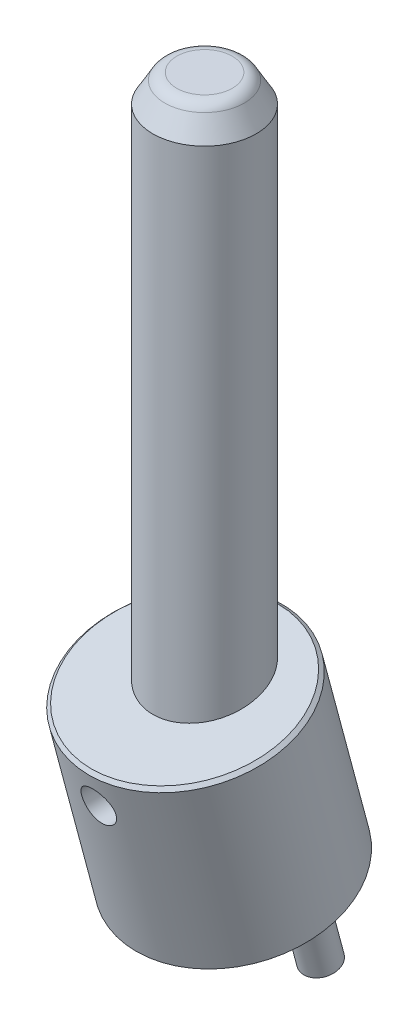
ISO-10303-21;
HEADER;
FILE_DESCRIPTION(('STEP AP214'),'2;1');
FILE_NAME('part.step','',(''),(''),'','','');
FILE_SCHEMA(('AUTOMOTIVE_DESIGN { 1 0 10303 214 1 1 1 1 }'));
ENDSEC;
DATA;
#1=APPLICATION_CONTEXT('core data for automotive mechanical design processes');
#2=APPLICATION_PROTOCOL_DEFINITION('international standard','automotive_design',2000,#1);
#3=PRODUCT_CONTEXT('',#1,'mechanical');
#4=PRODUCT('Part','Part','',(#3));
#5=PRODUCT_RELATED_PRODUCT_CATEGORY('part','',(#4));
#6=PRODUCT_DEFINITION_FORMATION('','',#4);
#7=PRODUCT_DEFINITION_CONTEXT('part definition',#1,'design');
#8=PRODUCT_DEFINITION('design','',#6,#7);
#9=PRODUCT_DEFINITION_SHAPE('','',#8);
#10=(LENGTH_UNIT() NAMED_UNIT(*) SI_UNIT(.MILLI.,.METRE.));
#11=(NAMED_UNIT(*) PLANE_ANGLE_UNIT() SI_UNIT($,.RADIAN.));
#12=(NAMED_UNIT(*) SI_UNIT($,.STERADIAN.) SOLID_ANGLE_UNIT());
#13=UNCERTAINTY_MEASURE_WITH_UNIT(LENGTH_MEASURE(1.E-05),#10,'distance_accuracy_value','');
#14=(GEOMETRIC_REPRESENTATION_CONTEXT(3) GLOBAL_UNCERTAINTY_ASSIGNED_CONTEXT((#13)) GLOBAL_UNIT_ASSIGNED_CONTEXT((#10,
#11,#12)) REPRESENTATION_CONTEXT('',''));
#15=CARTESIAN_POINT('',(0.,0.,0.));
#16=DIRECTION('',(0.,0.,1.));
#17=DIRECTION('',(1.,0.,0.));
#18=AXIS2_PLACEMENT_3D('',#15,#16,#17);
#19=CARTESIAN_POINT('',(0.,195.,0.));
#20=DIRECTION('',(0.,1.,0.));
#21=DIRECTION('',(-1.,0.,0.));
#22=AXIS2_PLACEMENT_3D('',#19,#20,#21);
#23=PLANE('',#22);
#24=CARTESIAN_POINT('',(0.,195.,0.));
#25=DIRECTION('',(0.,-1.,0.));
#26=DIRECTION('',(0.,0.,-1.));
#27=AXIS2_PLACEMENT_3D('',#24,#25,#26);
#28=CIRCLE('',#27,8.071796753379);
#29=CARTESIAN_POINT('',(0.,195.,-8.0717967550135));
#30=VERTEX_POINT('',#29);
#31=CARTESIAN_POINT('',(0.,195.,8.0717967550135));
#32=VERTEX_POINT('',#31);
#33=EDGE_CURVE('P0_E38',#30,#32,#28,.T.);
#34=ORIENTED_EDGE('',*,*,#33,.F.);
#35=CARTESIAN_POINT('',(0.,195.,0.));
#36=DIRECTION('',(0.,-1.,0.));
#37=DIRECTION('',(0.,0.,1.));
#38=AXIS2_PLACEMENT_3D('',#35,#36,#37);
#39=CIRCLE('',#38,8.071796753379);
#40=EDGE_CURVE('P0_E42',#32,#30,#39,.T.);
#41=ORIENTED_EDGE('',*,*,#40,.F.);
#42=EDGE_LOOP('',(#34,#41));
#43=FACE_BOUND('',#42,.T.);
#44=ADVANCED_FACE('P0_F17',(#43),#23,.T.);
#45=CARTESIAN_POINT('',(0.,191.,0.));
#46=DIRECTION('',(0.,1.,0.));
#47=DIRECTION('',(0.0058252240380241,0.,0.999983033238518));
#48=AXIS2_PLACEMENT_3D('',#45,#46,#47);
#49=TOROIDAL_SURFACE('',#48,8.071796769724,4.);
#50=ORIENTED_EDGE('',*,*,#33,.T.);
#51=ORIENTED_EDGE('',*,*,#40,.T.);
#52=EDGE_LOOP('',(#50,#51));
#53=FACE_BOUND('',#52,.T.);
#54=CARTESIAN_POINT('',(0.,193.000000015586,0.));
#55=DIRECTION('',(0.,-1.,0.));
#56=DIRECTION('',(0.,0.,1.));
#57=AXIS2_PLACEMENT_3D('',#54,#55,#56);
#58=CIRCLE('',#57,11.5358983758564);
#59=CARTESIAN_POINT('',(0.,193.000000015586,11.5358983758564));
#60=VERTEX_POINT('',#59);
#61=EDGE_CURVE('P0_E48',#60,#60,#58,.T.);
#62=ORIENTED_EDGE('',*,*,#61,.F.);
#63=EDGE_LOOP('',(#62));
#64=FACE_BOUND('',#63,.T.);
#65=ADVANCED_FACE('P0_F40',(#53,#64),#49,.T.);
#66=CARTESIAN_POINT('',(0.,0.,0.));
#67=DIRECTION('',(0.,1.,0.));
#68=DIRECTION('',(-1.,0.,0.));
#69=AXIS2_PLACEMENT_3D('',#66,#67,#68);
#70=PLANE('',#69);
#71=CARTESIAN_POINT('',(0.,0.,0.));
#72=DIRECTION('',(0.,1.,0.));
#73=DIRECTION('',(-1.,0.,0.));
#74=AXIS2_PLACEMENT_3D('',#71,#72,#73);
#75=CIRCLE('',#74,13.999996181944);
#76=CARTESIAN_POINT('',(-13.999996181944,0.,0.));
#77=VERTEX_POINT('',#76);
#78=EDGE_CURVE('P0_E85',#77,#77,#75,.T.);
#79=ORIENTED_EDGE('',*,*,#78,.F.);
#80=EDGE_LOOP('',(#79));
#81=FACE_BOUND('',#80,.T.);
#82=ADVANCED_FACE('P0_F76',(#81),#70,.F.);
#83=CARTESIAN_POINT('',(0.,26.,4.88675134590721));
#84=DIRECTION('',(0.,0.,1.));
#85=DIRECTION('',(0.,-1.,0.));
#86=AXIS2_PLACEMENT_3D('',#83,#84,#85);
#87=CONICAL_SURFACE('',#86,4.99999999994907,1.04719755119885);
#88=CARTESIAN_POINT('',(0.,26.0000000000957,1.99999999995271));
#89=VERTEX_POINT('',#88);
#90=VERTEX_LOOP('',#89);
#91=FACE_BOUND('',#90,.T.);
#92=CARTESIAN_POINT('',(0.,26.,4.886751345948));
#93=DIRECTION('',(0.,0.,1.));
#94=DIRECTION('',(0.,-1.,0.));
#95=AXIS2_PLACEMENT_3D('',#92,#93,#94);
#96=CIRCLE('',#95,5.);
#97=CARTESIAN_POINT('',(0.,21.,4.886751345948));
#98=VERTEX_POINT('',#97);
#99=EDGE_CURVE('P0_E82',#98,#98,#96,.T.);
#100=ORIENTED_EDGE('',*,*,#99,.T.);
#101=EDGE_LOOP('',(#100));
#102=FACE_BOUND('',#101,.T.);
#103=ADVANCED_FACE('P0_F116',(#91,#102),#87,.F.);
#104=CARTESIAN_POINT('',(0.,186.999999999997,0.));
#105=DIRECTION('',(0.,-1.,0.));
#106=DIRECTION('',(1.,0.,0.));
#107=AXIS2_PLACEMENT_3D('',#104,#105,#106);
#108=CONICAL_SURFACE('',#107,14.9999999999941,0.5235987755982);
#109=CARTESIAN_POINT('',(0.,187.,0.));
#110=DIRECTION('',(0.,1.,0.));
#111=DIRECTION('',(-1.,0.,0.));
#112=AXIS2_PLACEMENT_3D('',#109,#110,#111);
#113=CIRCLE('',#112,15.);
#114=CARTESIAN_POINT('',(-15.,187.,0.));
#115=VERTEX_POINT('',#114);
#116=EDGE_CURVE('P0_E92',#115,#115,#113,.F.);
#117=ORIENTED_EDGE('',*,*,#116,.F.);
#118=EDGE_LOOP('',(#117));
#119=FACE_BOUND('',#118,.T.);
#120=ORIENTED_EDGE('',*,*,#61,.T.);
#121=EDGE_LOOP('',(#120));
#122=FACE_BOUND('',#121,.T.);
#123=ADVANCED_FACE('P0_F108',(#119,#122),#108,.T.);
#124=CARTESIAN_POINT('',(0.,1.00000219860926,0.));
#125=DIRECTION('',(0.,1.,0.));
#126=DIRECTION('',(-1.,0.,0.));
#127=AXIS2_PLACEMENT_3D('',#124,#125,#126);
#128=CONICAL_SURFACE('',#127,14.9999981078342,0.785398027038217);
#129=CARTESIAN_POINT('',(0.,1.000000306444,0.));
#130=DIRECTION('',(0.,1.,0.));
#131=DIRECTION('',(-1.,0.,0.));
#132=AXIS2_PLACEMENT_3D('',#129,#130,#131);
#133=CIRCLE('',#132,15.);
#134=CARTESIAN_POINT('',(-15.,1.000000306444,0.));
#135=VERTEX_POINT('',#134);
#136=EDGE_CURVE('P0_E28',#135,#135,#133,.T.);
#137=ORIENTED_EDGE('',*,*,#136,.F.);
#138=EDGE_LOOP('',(#137));
#139=FACE_BOUND('',#138,.T.);
#140=ORIENTED_EDGE('',*,*,#78,.T.);
#141=EDGE_LOOP('',(#140));
#142=FACE_BOUND('',#141,.T.);
#143=ADVANCED_FACE('P0_F105',(#139,#142),#128,.T.);
#144=CARTESIAN_POINT('',(0.,26.,1.25));
#145=DIRECTION('',(0.,0.,1.));
#146=DIRECTION('',(0.,-1.,0.));
#147=AXIS2_PLACEMENT_3D('',#144,#145,#146);
#148=CYLINDRICAL_SURFACE('',#147,5.);
#149=ORIENTED_EDGE('',*,*,#99,.F.);
#150=EDGE_LOOP('',(#149));
#151=FACE_BOUND('',#150,.T.);
#152=CARTESIAN_POINT('',(0.,21.,15.));
#153=CARTESIAN_POINT('',(-0.136274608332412,21.0000000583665,14.9999999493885));
#154=CARTESIAN_POINT('',(-0.272550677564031,21.0055758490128,14.99813861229));
#155=CARTESIAN_POINT('',(-0.544142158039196,21.0278293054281,14.9907428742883));
#156=CARTESIAN_POINT('',(-0.679457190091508,21.044511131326,14.9852070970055));
#157=CARTESIAN_POINT('',(-0.948257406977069,21.0888508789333,14.9706027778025));
#158=CARTESIAN_POINT('',(-1.08174007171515,21.1165226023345,14.9615297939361));
#159=CARTESIAN_POINT('',(-1.34580155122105,21.1825990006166,14.9400929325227));
#160=CARTESIAN_POINT('',(-1.47637921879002,21.2210078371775,14.9277277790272));
#161=CARTESIAN_POINT('',(-1.7333461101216,21.308107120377,14.9000723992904));
#162=CARTESIAN_POINT('',(-1.85974572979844,21.356769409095,14.8847901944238));
#163=CARTESIAN_POINT('',(-2.10792399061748,21.4640368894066,14.8516789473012));
#164=CARTESIAN_POINT('',(-2.22970089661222,21.5226457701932,14.8338489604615));
#165=CARTESIAN_POINT('',(-2.58680471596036,21.7126929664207,14.7772227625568));
#166=CARTESIAN_POINT('',(-2.81420620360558,21.8584546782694,14.7352562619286));
#167=CARTESIAN_POINT('',(-3.24874257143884,22.1891412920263,14.6457020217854));
#168=CARTESIAN_POINT('',(-3.45501840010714,22.3751508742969,14.5979792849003));
#169=CARTESIAN_POINT('',(-3.8341436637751,22.7788198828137,14.5030192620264));
#170=CARTESIAN_POINT('',(-4.0069839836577,22.9964879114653,14.4557821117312));
#171=CARTESIAN_POINT('',(-4.31912807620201,23.4649273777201,14.3656662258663));
#172=CARTESIAN_POINT('',(-4.45732572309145,23.716470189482,14.3229516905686));
#173=CARTESIAN_POINT('',(-4.68909399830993,24.2408813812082,14.2487652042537));
#174=CARTESIAN_POINT('',(-4.78267844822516,24.5137431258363,14.2172897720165));
#175=CARTESIAN_POINT('',(-4.91936749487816,25.0633661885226,14.1705651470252));
#176=CARTESIAN_POINT('',(-4.96406724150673,25.3396860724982,14.15480479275));
#177=CARTESIAN_POINT('',(-5.00670561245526,25.8963186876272,14.1397828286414));
#178=CARTESIAN_POINT('',(-5.00465868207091,26.176630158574,14.1405161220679));
#179=CARTESIAN_POINT('',(-4.95509941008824,26.7196826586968,14.1579507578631));
#180=CARTESIAN_POINT('',(-4.90966912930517,26.9826412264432,14.1739208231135));
#181=CARTESIAN_POINT('',(-4.77803186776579,27.4969654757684,14.2188326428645));
#182=CARTESIAN_POINT('',(-4.69181981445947,27.7483297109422,14.2477760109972));
#183=CARTESIAN_POINT('',(-4.47968995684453,28.2370720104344,14.3158968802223));
#184=CARTESIAN_POINT('',(-4.3531541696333,28.4741591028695,14.3552319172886));
#185=CARTESIAN_POINT('',(-4.06444611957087,28.9243597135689,14.4396288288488));
#186=CARTESIAN_POINT('',(-3.90226546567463,29.1374675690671,14.4846920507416));
#187=CARTESIAN_POINT('',(-3.53674216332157,29.5454469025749,14.5783642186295));
#188=CARTESIAN_POINT('',(-3.33169626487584,29.7387915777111,14.6270356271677));
#189=CARTESIAN_POINT('',(-3.00176707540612,30.0011551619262,14.6970107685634));
#190=CARTESIAN_POINT('',(-2.88796886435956,30.0840532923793,14.7198467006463));
#191=CARTESIAN_POINT('',(-2.65358317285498,30.2400803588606,14.7638979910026));
#192=CARTESIAN_POINT('',(-2.53299841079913,30.3132131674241,14.7851139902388));
#193=CARTESIAN_POINT('',(-2.28442944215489,30.4499136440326,14.8255663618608));
#194=CARTESIAN_POINT('',(-2.15637801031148,30.5133662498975,14.8447781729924));
#195=CARTESIAN_POINT('',(-1.89503347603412,30.6291752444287,14.8803974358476));
#196=CARTESIAN_POINT('',(-1.76174256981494,30.681536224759,14.8968060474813));
#197=CARTESIAN_POINT('',(-1.49104566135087,30.7746452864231,14.9263287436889));
#198=CARTESIAN_POINT('',(-1.3536464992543,30.8154115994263,14.9394479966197));
#199=CARTESIAN_POINT('',(-1.0756272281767,30.8850331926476,14.9620340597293));
#200=CARTESIAN_POINT('',(-0.935008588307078,30.9138937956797,14.9715025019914));
#201=CARTESIAN_POINT('',(-0.662330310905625,30.9577132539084,14.9859443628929));
#202=CARTESIAN_POINT('',(-0.530427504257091,30.9735582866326,14.9912035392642));
#203=CARTESIAN_POINT('',(-0.265683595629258,30.994701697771,14.998231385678));
#204=CARTESIAN_POINT('',(-0.132842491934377,31.0000000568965,15.0000000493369));
#205=CARTESIAN_POINT('',(0.13627460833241,30.9999999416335,14.9999999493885));
#206=CARTESIAN_POINT('',(0.272550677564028,30.9944241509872,14.99813861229));
#207=CARTESIAN_POINT('',(0.544142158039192,30.9721706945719,14.9907428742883));
#208=CARTESIAN_POINT('',(0.679457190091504,30.955488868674,14.9852070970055));
#209=CARTESIAN_POINT('',(0.948257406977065,30.9111491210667,14.9706027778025));
#210=CARTESIAN_POINT('',(1.08174007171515,30.8834773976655,14.9615297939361));
#211=CARTESIAN_POINT('',(1.34580155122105,30.8174009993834,14.9400929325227));
#212=CARTESIAN_POINT('',(1.47637921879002,30.7789921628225,14.9277277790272));
#213=CARTESIAN_POINT('',(1.7333461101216,30.691892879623,14.9000723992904));
#214=CARTESIAN_POINT('',(1.85974572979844,30.643230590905,14.8847901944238));
#215=CARTESIAN_POINT('',(2.10792399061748,30.5359631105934,14.8516789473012));
#216=CARTESIAN_POINT('',(2.22970089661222,30.4773542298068,14.8338489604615));
#217=CARTESIAN_POINT('',(2.58680471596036,30.2873070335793,14.7772227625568));
#218=CARTESIAN_POINT('',(2.81420620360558,30.1415453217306,14.7352562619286));
#219=CARTESIAN_POINT('',(3.24874257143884,29.8108587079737,14.6457020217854));
#220=CARTESIAN_POINT('',(3.45501840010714,29.6248491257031,14.5979792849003));
#221=CARTESIAN_POINT('',(3.8341436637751,29.2211801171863,14.5030192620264));
#222=CARTESIAN_POINT('',(4.0069839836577,29.0035120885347,14.4557821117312));
#223=CARTESIAN_POINT('',(4.31912807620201,28.5350726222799,14.3656662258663));
#224=CARTESIAN_POINT('',(4.45732572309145,28.283529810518,14.3229516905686));
#225=CARTESIAN_POINT('',(4.68909399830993,27.7591186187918,14.2487652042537));
#226=CARTESIAN_POINT('',(4.78267844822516,27.4862568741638,14.2172897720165));
#227=CARTESIAN_POINT('',(4.91936749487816,26.9366338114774,14.1705651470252));
#228=CARTESIAN_POINT('',(4.96406724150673,26.6603139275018,14.15480479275));
#229=CARTESIAN_POINT('',(5.00670561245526,26.1036813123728,14.1397828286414));
#230=CARTESIAN_POINT('',(5.00465868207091,25.823369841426,14.1405161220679));
#231=CARTESIAN_POINT('',(4.95509941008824,25.2803173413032,14.1579507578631));
#232=CARTESIAN_POINT('',(4.90966912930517,25.0173587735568,14.1739208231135));
#233=CARTESIAN_POINT('',(4.77803186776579,24.5030345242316,14.2188326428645));
#234=CARTESIAN_POINT('',(4.69181981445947,24.2516702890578,14.2477760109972));
#235=CARTESIAN_POINT('',(4.47968995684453,23.7629279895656,14.3158968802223));
#236=CARTESIAN_POINT('',(4.35315416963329,23.5258408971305,14.3552319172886));
#237=CARTESIAN_POINT('',(4.06444611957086,23.0756402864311,14.4396288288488));
#238=CARTESIAN_POINT('',(3.90226546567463,22.8625324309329,14.4846920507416));
#239=CARTESIAN_POINT('',(3.53674216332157,22.4545530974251,14.5783642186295));
#240=CARTESIAN_POINT('',(3.33169626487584,22.2612084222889,14.6270356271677));
#241=CARTESIAN_POINT('',(3.00176707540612,21.9988448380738,14.6970107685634));
#242=CARTESIAN_POINT('',(2.88796886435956,21.9159467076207,14.7198467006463));
#243=CARTESIAN_POINT('',(2.65358317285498,21.7599196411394,14.7638979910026));
#244=CARTESIAN_POINT('',(2.53299841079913,21.6867868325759,14.7851139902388));
#245=CARTESIAN_POINT('',(2.28442944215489,21.5500863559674,14.8255663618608));
#246=CARTESIAN_POINT('',(2.15637801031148,21.4866337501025,14.8447781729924));
#247=CARTESIAN_POINT('',(1.89503347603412,21.3708247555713,14.8803974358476));
#248=CARTESIAN_POINT('',(1.76174256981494,21.318463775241,14.8968060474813));
#249=CARTESIAN_POINT('',(1.49104566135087,21.2253547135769,14.9263287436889));
#250=CARTESIAN_POINT('',(1.3536464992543,21.1845884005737,14.9394479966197));
#251=CARTESIAN_POINT('',(1.07562722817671,21.1149668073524,14.9620340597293));
#252=CARTESIAN_POINT('',(0.935008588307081,21.0861062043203,14.9715025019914));
#253=CARTESIAN_POINT('',(0.662330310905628,21.0422867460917,14.9859443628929));
#254=CARTESIAN_POINT('',(0.530427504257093,21.0264417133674,14.9912035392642));
#255=CARTESIAN_POINT('',(0.265683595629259,21.005298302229,14.998231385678));
#256=CARTESIAN_POINT('',(0.132842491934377,20.9999999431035,15.0000000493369));
#257=CARTESIAN_POINT('',(0.,21.,15.));
#258=B_SPLINE_CURVE_WITH_KNOTS('',3,(#152,#153,#154,#155,#156,#157,#158,#159,#160,#161,#162,
#163,#164,#165,#166,#167,#168,#169,#170,#171,#172,#173,#174,#175,#176,#177,#178,#179,#180,#181,
#182,#183,#184,#185,#186,#187,#188,#189,#190,#191,#192,#193,#194,#195,#196,#197,#198,#199,#200,
#201,#202,#203,#204,#205,#206,#207,#208,#209,#210,#211,#212,#213,#214,#215,#216,#217,#218,#219,
#220,#221,#222,#223,#224,#225,#226,#227,#228,#229,#230,#231,#232,#233,#234,#235,#236,#237,#238,
#239,#240,#241,#242,#243,#244,#245,#246,#247,#248,#249,#250,#251,#252,#253,#254,#255,#256,#257),
.UNSPECIFIED.,.T.,.F.,(4,2,2,2,2,2,2,2,2,2,2,2,2,2,2,2,2,2,2,2,2,2,2,2,2,2,2,2,2,2,2,2,2,2,2,2,
2,2,2,2,2,2,2,2,2,2,2,2,2,2,2,2,4),(0.,0.408700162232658,0.817553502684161,1.22692193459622,
1.6364492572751,2.04486626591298,2.45343508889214,3.26962321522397,4.11140352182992,
4.9534129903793,5.81961254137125,6.68554356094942,7.52228757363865,8.3587730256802,
9.15703078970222,9.95538786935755,10.7666215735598,11.5780464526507,12.4317109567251,
12.8591940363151,13.286507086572,13.7185586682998,14.150431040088,14.5816205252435,
15.0126170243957,15.4110232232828,15.8094301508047,16.2181303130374,16.6269836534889,
17.0363520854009,17.4458794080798,17.8542964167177,18.2628652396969,19.0790533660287,
19.9208336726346,20.762843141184,21.629042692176,22.4949737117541,23.3317177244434,
24.1682031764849,24.9664609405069,25.7648180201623,26.5760517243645,27.3874766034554,
28.2411411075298,28.6686241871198,29.0959372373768,29.5279888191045,29.9598611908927,
30.3910506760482,30.8220471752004,31.2204533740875,31.6188603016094),.UNSPECIFIED.);
#259=CARTESIAN_POINT('',(0.,21.,15.));
#260=VERTEX_POINT('',#259);
#261=EDGE_CURVE('P0_E11',#260,#260,#258,.T.);
#262=ORIENTED_EDGE('',*,*,#261,.F.);
#263=EDGE_LOOP('',(#262));
#264=FACE_BOUND('',#263,.T.);
#265=ADVANCED_FACE('P0_F107',(#151,#264),#148,.F.);
#266=CARTESIAN_POINT('',(0.,-9.75,0.));
#267=DIRECTION('',(0.,1.,0.));
#268=DIRECTION('',(-1.,0.,0.));
#269=AXIS2_PLACEMENT_3D('',#266,#267,#268);
#270=CYLINDRICAL_SURFACE('',#269,15.);
#271=ORIENTED_EDGE('',*,*,#116,.T.);
#272=EDGE_LOOP('',(#271));
#273=FACE_BOUND('',#272,.T.);
#274=ORIENTED_EDGE('',*,*,#136,.T.);
#275=EDGE_LOOP('',(#274));
#276=FACE_BOUND('',#275,.T.);
#277=ORIENTED_EDGE('',*,*,#261,.T.);
#278=EDGE_LOOP('',(#277));
#279=FACE_BOUND('',#278,.T.);
#280=ADVANCED_FACE('P0_F102',(#273,#276,#279),#270,.T.);
#281=CLOSED_SHELL('',(#44,#65,#82,#103,#123,#143,#265,#280));
#282=MANIFOLD_SOLID_BREP('P0_B1',#281);
#283=CARTESIAN_POINT('',(0.,-24.1677221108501,-12.3217781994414));
#284=DIRECTION('',(0.,-0.965925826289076,-0.258819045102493));
#285=DIRECTION('',(0.,0.258819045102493,-0.965925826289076));
#286=AXIS2_PLACEMENT_3D('',#283,#284,#285);
#287=PLANE('',#286);
#288=CARTESIAN_POINT('',(-21.5,-24.1677221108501,-12.3217781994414));
#289=DIRECTION('',(0.,-0.965925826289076,-0.258819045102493));
#290=DIRECTION('',(0.,0.258819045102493,-0.965925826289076));
#291=AXIS2_PLACEMENT_3D('',#288,#289,#290);
#292=CIRCLE('',#291,4.50000075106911);
#293=CARTESIAN_POINT('',(-21.5,-23.0030362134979,-16.6684451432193));
#294=VERTEX_POINT('',#293);
#295=EDGE_CURVE('P1_E17',#294,#294,#292,.F.);
#296=ORIENTED_EDGE('',*,*,#295,.F.);
#297=EDGE_LOOP('',(#296));
#298=FACE_BOUND('',#297,.T.);
#299=ADVANCED_FACE('P1_F14',(#298),#287,.T.);
#300=CARTESIAN_POINT('',(0.,-24.1677221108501,-12.3217781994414));
#301=DIRECTION('',(0.,-0.965925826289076,-0.258819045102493));
#302=DIRECTION('',(0.,0.258819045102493,-0.965925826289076));
#303=AXIS2_PLACEMENT_3D('',#300,#301,#302);
#304=PLANE('',#303);
#305=CARTESIAN_POINT('',(21.5,-24.1677221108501,-12.3217781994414));
#306=DIRECTION('',(0.,-0.965925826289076,-0.258819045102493));
#307=DIRECTION('',(0.,0.258819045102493,-0.965925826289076));
#308=AXIS2_PLACEMENT_3D('',#305,#306,#307);
#309=CIRCLE('',#308,4.50000075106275);
#310=CARTESIAN_POINT('',(21.5,-23.0030362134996,-16.6684451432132));
#311=VERTEX_POINT('',#310);
#312=EDGE_CURVE('P1_E121',#311,#311,#309,.F.);
#313=ORIENTED_EDGE('',*,*,#312,.F.);
#314=EDGE_LOOP('',(#313));
#315=FACE_BOUND('',#314,.T.);
#316=ADVANCED_FACE('P1_F111',(#315),#304,.T.);
#317=CARTESIAN_POINT('',(0.,-1.62717062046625E-12,-9.59302082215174E-13));
#318=DIRECTION('',(0.,-1.,0.));
#319=DIRECTION('',(0.,0.,-1.));
#320=AXIS2_PLACEMENT_3D('',#317,#318,#319);
#321=PLANE('',#320);
#322=CARTESIAN_POINT('',(0.,-3.64291929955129E-13,-6.07500161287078E-12));
#323=DIRECTION('',(0.,-1.,0.));
#324=DIRECTION('',(0.,0.,-1.));
#325=AXIS2_PLACEMENT_3D('',#322,#323,#324);
#326=CIRCLE('',#325,15.);
#327=CARTESIAN_POINT('',(0.,-3.64291929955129E-13,-15.0000000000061));
#328=VERTEX_POINT('',#327);
#329=EDGE_CURVE('P1_E36',#328,#328,#326,.F.);
#330=ORIENTED_EDGE('',*,*,#329,.T.);
#331=EDGE_LOOP('',(#330));
#332=FACE_BOUND('',#331,.T.);
#333=ADVANCED_FACE('P1_F108',(#332),#321,.F.);
#334=CARTESIAN_POINT('',(-21.5,-23.6847586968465,-12.1923685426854));
#335=DIRECTION('',(0.,0.965925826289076,0.258819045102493));
#336=DIRECTION('',(0.,-0.258819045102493,0.965925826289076));
#337=AXIS2_PLACEMENT_3D('',#334,#335,#336);
#338=CONICAL_SURFACE('',#337,5.00000135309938,0.785398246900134);
#339=CARTESIAN_POINT('',(-21.5,-23.6847573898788,-12.1923681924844));
#340=DIRECTION('',(0.,-0.965925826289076,-0.258819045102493));
#341=DIRECTION('',(0.,0.258819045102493,-0.965925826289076));
#342=AXIS2_PLACEMENT_3D('',#339,#340,#341);
#343=CIRCLE('',#342,5.);
#344=CARTESIAN_POINT('',(-21.5,-22.3906621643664,-17.0219973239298));
#345=VERTEX_POINT('',#344);
#346=EDGE_CURVE('P1_E33',#345,#345,#343,.F.);
#347=ORIENTED_EDGE('',*,*,#346,.F.);
#348=EDGE_LOOP('',(#347));
#349=FACE_BOUND('',#348,.T.);
#350=ORIENTED_EDGE('',*,*,#295,.T.);
#351=EDGE_LOOP('',(#350));
#352=FACE_BOUND('',#351,.T.);
#353=ADVANCED_FACE('P1_F104',(#349,#352),#338,.T.);
#354=CARTESIAN_POINT('',(21.5,-23.6847586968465,-12.1923685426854));
#355=DIRECTION('',(0.,0.965925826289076,0.258819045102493));
#356=DIRECTION('',(0.,-0.258819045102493,0.965925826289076));
#357=AXIS2_PLACEMENT_3D('',#354,#355,#356);
#358=CONICAL_SURFACE('',#357,5.00000135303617,0.785398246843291);
#359=CARTESIAN_POINT('',(21.5,-23.6847573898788,-12.1923681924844));
#360=DIRECTION('',(0.,-0.965925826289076,-0.258819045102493));
#361=DIRECTION('',(0.,0.258819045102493,-0.965925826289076));
#362=AXIS2_PLACEMENT_3D('',#359,#360,#361);
#363=CIRCLE('',#362,5.);
#364=CARTESIAN_POINT('',(21.5,-22.3906621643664,-17.0219973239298));
#365=VERTEX_POINT('',#364);
#366=EDGE_CURVE('P1_E29',#365,#365,#363,.F.);
#367=ORIENTED_EDGE('',*,*,#366,.F.);
#368=EDGE_LOOP('',(#367));
#369=FACE_BOUND('',#368,.T.);
#370=ORIENTED_EDGE('',*,*,#312,.T.);
#371=EDGE_LOOP('',(#370));
#372=FACE_BOUND('',#371,.T.);
#373=ADVANCED_FACE('P1_F99',(#369,#372),#358,.T.);
#374=CARTESIAN_POINT('',(0.,61.8750000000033,-6.0732668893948E-12));
#375=DIRECTION('',(0.,-1.,0.));
#376=DIRECTION('',(0.,0.,-1.));
#377=AXIS2_PLACEMENT_3D('',#374,#375,#376);
#378=CYLINDRICAL_SURFACE('',#377,15.);
#379=CARTESIAN_POINT('',(0.,45.0000000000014,-6.07500161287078E-12));
#380=DIRECTION('',(0.,0.965925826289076,0.258819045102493));
#381=DIRECTION('',(0.,-0.258819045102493,0.965925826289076));
#382=AXIS2_PLACEMENT_3D('',#379,#380,#381);
#383=ELLIPSE('',#382,15.5291427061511,15.);
#384=CARTESIAN_POINT('',(0.,40.980762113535,14.9999999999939));
#385=VERTEX_POINT('',#384);
#386=EDGE_CURVE('P1_E32',#385,#385,#383,.F.);
#387=ORIENTED_EDGE('',*,*,#386,.F.);
#388=EDGE_LOOP('',(#387));
#389=FACE_BOUND('',#388,.T.);
#390=ORIENTED_EDGE('',*,*,#329,.F.);
#391=EDGE_LOOP('',(#390));
#392=FACE_BOUND('',#391,.T.);
#393=CARTESIAN_POINT('',(0.,30.9999999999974,14.9999999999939));
#394=CARTESIAN_POINT('',(-0.136274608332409,30.9999999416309,14.9999999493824));
#395=CARTESIAN_POINT('',(-0.272550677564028,30.9944241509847,14.9981386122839));
#396=CARTESIAN_POINT('',(-0.544142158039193,30.9721706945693,14.9907428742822));
#397=CARTESIAN_POINT('',(-0.679457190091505,30.9554888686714,14.9852070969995));
#398=CARTESIAN_POINT('',(-0.948257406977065,30.9111491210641,14.9706027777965));
#399=CARTESIAN_POINT('',(-1.08174007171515,30.883477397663,14.96152979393));
#400=CARTESIAN_POINT('',(-1.34580155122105,30.8174009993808,14.9400929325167));
#401=CARTESIAN_POINT('',(-1.47637921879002,30.77899216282,14.9277277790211));
#402=CARTESIAN_POINT('',(-1.7333461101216,30.6918928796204,14.9000723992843));
#403=CARTESIAN_POINT('',(-1.85974572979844,30.6432305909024,14.8847901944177));
#404=CARTESIAN_POINT('',(-2.10792399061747,30.5359631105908,14.8516789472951));
#405=CARTESIAN_POINT('',(-2.22970089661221,30.4773542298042,14.8338489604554));
#406=CARTESIAN_POINT('',(-2.58680471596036,30.2873070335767,14.7772227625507));
#407=CARTESIAN_POINT('',(-2.81420620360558,30.141545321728,14.7352562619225));
#408=CARTESIAN_POINT('',(-3.24874257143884,29.8108587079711,14.6457020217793));
#409=CARTESIAN_POINT('',(-3.45501840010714,29.6248491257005,14.5979792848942));
#410=CARTESIAN_POINT('',(-3.8341436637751,29.2211801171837,14.5030192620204));
#411=CARTESIAN_POINT('',(-4.0069839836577,29.0035120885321,14.4557821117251));
#412=CARTESIAN_POINT('',(-4.31912807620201,28.5350726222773,14.3656662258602));
#413=CARTESIAN_POINT('',(-4.45732572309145,28.2835298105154,14.3229516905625));
#414=CARTESIAN_POINT('',(-4.68909399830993,27.7591186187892,14.2487652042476));
#415=CARTESIAN_POINT('',(-4.78267844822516,27.4862568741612,14.2172897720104));
#416=CARTESIAN_POINT('',(-4.91936749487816,26.9366338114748,14.1705651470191));
#417=CARTESIAN_POINT('',(-4.96406724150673,26.6603139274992,14.1548047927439));
#418=CARTESIAN_POINT('',(-5.00670561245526,26.1036813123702,14.1397828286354));
#419=CARTESIAN_POINT('',(-5.00465868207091,25.8233698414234,14.1405161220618));
#420=CARTESIAN_POINT('',(-4.95509941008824,25.2803173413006,14.157950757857));
#421=CARTESIAN_POINT('',(-4.90966912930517,25.0173587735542,14.1739208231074));
#422=CARTESIAN_POINT('',(-4.77803186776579,24.503034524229,14.2188326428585));
#423=CARTESIAN_POINT('',(-4.69181981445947,24.2516702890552,14.2477760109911));
#424=CARTESIAN_POINT('',(-4.47968995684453,23.762927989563,14.3158968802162));
#425=CARTESIAN_POINT('',(-4.3531541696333,23.5258408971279,14.3552319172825));
#426=CARTESIAN_POINT('',(-4.06444611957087,23.0756402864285,14.4396288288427));
#427=CARTESIAN_POINT('',(-3.90226546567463,22.8625324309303,14.4846920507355));
#428=CARTESIAN_POINT('',(-3.53674216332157,22.4545530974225,14.5783642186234));
#429=CARTESIAN_POINT('',(-3.33169626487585,22.2612084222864,14.6270356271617));
#430=CARTESIAN_POINT('',(-3.00176707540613,21.9988448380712,14.6970107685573));
#431=CARTESIAN_POINT('',(-2.88796886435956,21.9159467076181,14.7198467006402));
#432=CARTESIAN_POINT('',(-2.65358317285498,21.7599196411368,14.7638979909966));
#433=CARTESIAN_POINT('',(-2.53299841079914,21.6867868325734,14.7851139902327));
#434=CARTESIAN_POINT('',(-2.2844294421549,21.5500863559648,14.8255663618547));
#435=CARTESIAN_POINT('',(-2.15637801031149,21.4866337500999,14.8447781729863));
#436=CARTESIAN_POINT('',(-1.89503347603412,21.3708247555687,14.8803974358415));
#437=CARTESIAN_POINT('',(-1.76174256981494,21.3184637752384,14.8968060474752));
#438=CARTESIAN_POINT('',(-1.49104566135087,21.2253547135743,14.9263287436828));
#439=CARTESIAN_POINT('',(-1.35364649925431,21.1845884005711,14.9394479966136));
#440=CARTESIAN_POINT('',(-1.07562722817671,21.1149668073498,14.9620340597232));
#441=CARTESIAN_POINT('',(-0.935008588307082,21.0861062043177,14.9715025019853));
#442=CARTESIAN_POINT('',(-0.66233031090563,21.0422867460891,14.9859443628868));
#443=CARTESIAN_POINT('',(-0.530427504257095,21.0264417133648,14.9912035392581));
#444=CARTESIAN_POINT('',(-0.265683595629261,21.0052983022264,14.9982313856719));
#445=CARTESIAN_POINT('',(-0.132842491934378,20.9999999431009,15.0000000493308));
#446=CARTESIAN_POINT('',(0.136274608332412,21.0000000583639,14.9999999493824));
#447=CARTESIAN_POINT('',(0.272550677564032,21.0055758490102,14.9981386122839));
#448=CARTESIAN_POINT('',(0.544142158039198,21.0278293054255,14.9907428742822));
#449=CARTESIAN_POINT('',(0.67945719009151,21.0445111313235,14.9852070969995));
#450=CARTESIAN_POINT('',(0.94825740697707,21.0888508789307,14.9706027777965));
#451=CARTESIAN_POINT('',(1.08174007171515,21.1165226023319,14.96152979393));
#452=CARTESIAN_POINT('',(1.34580155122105,21.182599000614,14.9400929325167));
#453=CARTESIAN_POINT('',(1.47637921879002,21.2210078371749,14.9277277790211));
#454=CARTESIAN_POINT('',(1.7333461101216,21.3081071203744,14.9000723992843));
#455=CARTESIAN_POINT('',(1.85974572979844,21.3567694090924,14.8847901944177));
#456=CARTESIAN_POINT('',(2.10792399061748,21.464036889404,14.8516789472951));
#457=CARTESIAN_POINT('',(2.22970089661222,21.5226457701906,14.8338489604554));
#458=CARTESIAN_POINT('',(2.58680471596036,21.7126929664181,14.7772227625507));
#459=CARTESIAN_POINT('',(2.81420620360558,21.8584546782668,14.7352562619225));
#460=CARTESIAN_POINT('',(3.24874257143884,22.1891412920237,14.6457020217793));
#461=CARTESIAN_POINT('',(3.45501840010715,22.3751508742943,14.5979792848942));
#462=CARTESIAN_POINT('',(3.8341436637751,22.7788198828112,14.5030192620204));
#463=CARTESIAN_POINT('',(4.0069839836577,22.9964879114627,14.4557821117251));
#464=CARTESIAN_POINT('',(4.31912807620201,23.4649273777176,14.3656662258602));
#465=CARTESIAN_POINT('',(4.45732572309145,23.7164701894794,14.3229516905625));
#466=CARTESIAN_POINT('',(4.68909399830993,24.2408813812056,14.2487652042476));
#467=CARTESIAN_POINT('',(4.78267844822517,24.5137431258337,14.2172897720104));
#468=CARTESIAN_POINT('',(4.91936749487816,25.06336618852,14.1705651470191));
#469=CARTESIAN_POINT('',(4.96406724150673,25.3396860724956,14.1548047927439));
#470=CARTESIAN_POINT('',(5.00670561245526,25.8963186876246,14.1397828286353));
#471=CARTESIAN_POINT('',(5.00465868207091,26.1766301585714,14.1405161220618));
#472=CARTESIAN_POINT('',(4.95509941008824,26.7196826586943,14.157950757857));
#473=CARTESIAN_POINT('',(4.90966912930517,26.9826412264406,14.1739208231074));
#474=CARTESIAN_POINT('',(4.77803186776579,27.4969654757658,14.2188326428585));
#475=CARTESIAN_POINT('',(4.69181981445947,27.7483297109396,14.2477760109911));
#476=CARTESIAN_POINT('',(4.47968995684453,28.2370720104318,14.3158968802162));
#477=CARTESIAN_POINT('',(4.35315416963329,28.4741591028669,14.3552319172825));
#478=CARTESIAN_POINT('',(4.06444611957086,28.9243597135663,14.4396288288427));
#479=CARTESIAN_POINT('',(3.90226546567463,29.1374675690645,14.4846920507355));
#480=CARTESIAN_POINT('',(3.53674216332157,29.5454469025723,14.5783642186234));
#481=CARTESIAN_POINT('',(3.33169626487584,29.7387915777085,14.6270356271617));
#482=CARTESIAN_POINT('',(3.00176707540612,30.0011551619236,14.6970107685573));
#483=CARTESIAN_POINT('',(2.88796886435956,30.0840532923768,14.7198467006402));
#484=CARTESIAN_POINT('',(2.65358317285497,30.240080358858,14.7638979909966));
#485=CARTESIAN_POINT('',(2.53299841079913,30.3132131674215,14.7851139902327));
#486=CARTESIAN_POINT('',(2.28442944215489,30.44991364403,14.8255663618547));
#487=CARTESIAN_POINT('',(2.15637801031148,30.5133662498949,14.8447781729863));
#488=CARTESIAN_POINT('',(1.89503347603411,30.6291752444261,14.8803974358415));
#489=CARTESIAN_POINT('',(1.76174256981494,30.6815362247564,14.8968060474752));
#490=CARTESIAN_POINT('',(1.49104566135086,30.7746452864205,14.9263287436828));
#491=CARTESIAN_POINT('',(1.3536464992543,30.8154115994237,14.9394479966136));
#492=CARTESIAN_POINT('',(1.0756272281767,30.885033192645,14.9620340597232));
#493=CARTESIAN_POINT('',(0.935008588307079,30.9138937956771,14.9715025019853));
#494=CARTESIAN_POINT('',(0.662330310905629,30.9577132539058,14.9859443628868));
#495=CARTESIAN_POINT('',(0.530427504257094,30.97355828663,14.9912035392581));
#496=CARTESIAN_POINT('',(0.26568359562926,30.9947016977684,14.9982313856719));
#497=CARTESIAN_POINT('',(0.132842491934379,31.000000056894,15.0000000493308));
#498=CARTESIAN_POINT('',(0.,30.9999999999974,14.9999999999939));
#499=B_SPLINE_CURVE_WITH_KNOTS('',3,(#393,#394,#395,#396,#397,#398,#399,#400,#401,#402,#403,
#404,#405,#406,#407,#408,#409,#410,#411,#412,#413,#414,#415,#416,#417,#418,#419,#420,#421,#422,
#423,#424,#425,#426,#427,#428,#429,#430,#431,#432,#433,#434,#435,#436,#437,#438,#439,#440,#441,
#442,#443,#444,#445,#446,#447,#448,#449,#450,#451,#452,#453,#454,#455,#456,#457,#458,#459,#460,
#461,#462,#463,#464,#465,#466,#467,#468,#469,#470,#471,#472,#473,#474,#475,#476,#477,#478,#479,
#480,#481,#482,#483,#484,#485,#486,#487,#488,#489,#490,#491,#492,#493,#494,#495,#496,#497,#498),
.UNSPECIFIED.,.T.,.F.,(4,2,2,2,2,2,2,2,2,2,2,2,2,2,2,2,2,2,2,2,2,2,2,2,2,2,2,2,2,2,2,2,2,2,2,2,
2,2,2,2,2,2,2,2,2,2,2,2,2,2,2,2,4),(0.,0.408700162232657,0.81755350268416,1.22692193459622,
1.63644925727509,2.04486626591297,2.45343508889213,3.26962321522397,4.11140352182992,
4.9534129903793,5.81961254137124,6.68554356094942,7.52228757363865,8.3587730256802,
9.15703078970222,9.95538786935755,10.7666215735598,11.5780464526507,12.4317109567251,
12.8591940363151,13.286507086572,13.7185586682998,14.150431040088,14.5816205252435,
15.0126170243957,15.4110232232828,15.8094301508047,16.2181303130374,16.6269836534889,
17.0363520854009,17.4458794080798,17.8542964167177,18.2628652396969,19.0790533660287,
19.9208336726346,20.762843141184,21.629042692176,22.4949737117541,23.3317177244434,
24.1682031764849,24.9664609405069,25.7648180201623,26.5760517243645,27.3874766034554,
28.2411411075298,28.6686241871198,29.0959372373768,29.5279888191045,29.9598611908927,
30.3910506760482,30.8220471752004,31.2204533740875,31.6188603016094),.UNSPECIFIED.);
#500=CARTESIAN_POINT('',(0.,30.9999999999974,14.9999999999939));
#501=VERTEX_POINT('',#500);
#502=EDGE_CURVE('P1_E84',#501,#501,#499,.T.);
#503=ORIENTED_EDGE('',*,*,#502,.T.);
#504=EDGE_LOOP('',(#503));
#505=FACE_BOUND('',#504,.T.);
#506=ADVANCED_FACE('P1_F93',(#389,#392,#505),#378,.F.);
#507=CARTESIAN_POINT('',(-21.5,-9.678834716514,-8.439492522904));
#508=DIRECTION('',(0.,-0.965925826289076,-0.258819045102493));
#509=DIRECTION('',(0.,0.258819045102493,-0.965925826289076));
#510=AXIS2_PLACEMENT_3D('',#507,#508,#509);
#511=CYLINDRICAL_SURFACE('',#510,5.);
#512=CARTESIAN_POINT('',(-21.5,-9.678834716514,-8.439492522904));
#513=DIRECTION('',(0.,-0.965925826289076,-0.258819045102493));
#514=DIRECTION('',(0.,0.258819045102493,-0.965925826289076));
#515=AXIS2_PLACEMENT_3D('',#512,#513,#514);
#516=CIRCLE('',#515,5.);
#517=CARTESIAN_POINT('',(-21.5,-8.38473949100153,-13.2691216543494));
#518=VERTEX_POINT('',#517);
#519=EDGE_CURVE('P1_E80',#518,#518,#516,.T.);
#520=ORIENTED_EDGE('',*,*,#519,.T.);
#521=EDGE_LOOP('',(#520));
#522=FACE_BOUND('',#521,.T.);
#523=ORIENTED_EDGE('',*,*,#346,.T.);
#524=EDGE_LOOP('',(#523));
#525=FACE_BOUND('',#524,.T.);
#526=ADVANCED_FACE('P1_F98',(#522,#525),#511,.T.);
#527=CARTESIAN_POINT('',(21.5,-9.678834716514,-8.439492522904));
#528=DIRECTION('',(0.,-0.965925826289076,-0.258819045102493));
#529=DIRECTION('',(0.,0.258819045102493,-0.965925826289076));
#530=AXIS2_PLACEMENT_3D('',#527,#528,#529);
#531=CYLINDRICAL_SURFACE('',#530,5.);
#532=CARTESIAN_POINT('',(21.5,-9.678834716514,-8.439492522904));
#533=DIRECTION('',(0.,-0.965925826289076,-0.258819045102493));
#534=DIRECTION('',(0.,0.258819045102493,-0.965925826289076));
#535=AXIS2_PLACEMENT_3D('',#532,#533,#534);
#536=CIRCLE('',#535,5.);
#537=CARTESIAN_POINT('',(21.5,-8.38473949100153,-13.2691216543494));
#538=VERTEX_POINT('',#537);
#539=EDGE_CURVE('P1_E76',#538,#538,#536,.T.);
#540=ORIENTED_EDGE('',*,*,#539,.T.);
#541=EDGE_LOOP('',(#540));
#542=FACE_BOUND('',#541,.T.);
#543=ORIENTED_EDGE('',*,*,#366,.T.);
#544=EDGE_LOOP('',(#543));
#545=FACE_BOUND('',#544,.T.);
#546=ADVANCED_FACE('P1_F178',(#542,#545),#531,.T.);
#547=CARTESIAN_POINT('',(0.,43.4470857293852,5.79555495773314));
#548=DIRECTION('',(0.,0.965925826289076,0.258819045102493));
#549=DIRECTION('',(0.,-0.258819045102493,0.965925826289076));
#550=AXIS2_PLACEMENT_3D('',#547,#548,#549);
#551=PLANE('',#550);
#552=ORIENTED_EDGE('',*,*,#386,.T.);
#553=EDGE_LOOP('',(#552));
#554=FACE_BOUND('',#553,.T.);
#555=CARTESIAN_POINT('',(0.,43.4470857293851,5.79555495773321));
#556=DIRECTION('',(0.,0.965925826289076,0.258819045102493));
#557=DIRECTION('',(0.,-0.258819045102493,0.965925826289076));
#558=AXIS2_PLACEMENT_3D('',#555,#556,#557);
#559=CIRCLE('',#558,27.9999945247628);
#560=CARTESIAN_POINT('',(0.,36.200153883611,32.8414728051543));
#561=VERTEX_POINT('',#560);
#562=EDGE_CURVE('P1_E46',#561,#561,#559,.F.);
#563=ORIENTED_EDGE('',*,*,#562,.F.);
#564=EDGE_LOOP('',(#563));
#565=FACE_BOUND('',#564,.T.);
#566=ADVANCED_FACE('P1_F71',(#554,#565),#551,.T.);
#567=CARTESIAN_POINT('',(0.,25.9999999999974,-7.09102540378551));
#568=DIRECTION('',(0.,0.,1.));
#569=DIRECTION('',(0.,-1.,0.));
#570=AXIS2_PLACEMENT_3D('',#567,#568,#569);
#571=CYLINDRICAL_SURFACE('',#570,5.);
#572=ORIENTED_EDGE('',*,*,#502,.F.);
#573=EDGE_LOOP('',(#572));
#574=FACE_BOUND('',#573,.T.);
#575=CARTESIAN_POINT('',(0.,20.9999999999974,29.8038856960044));
#576=CARTESIAN_POINT('',(-0.13972339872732,21.0000005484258,29.8038855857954));
#577=CARTESIAN_POINT('',(-0.279460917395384,21.0058611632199,29.8044081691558));
#578=CARTESIAN_POINT('',(-0.557998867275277,21.0292674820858,29.806516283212));
#579=CARTESIAN_POINT('',(-0.696798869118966,21.0468182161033,29.8081022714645));
#580=CARTESIAN_POINT('',(-0.972634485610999,21.0935168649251,29.8123931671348));
#581=CARTESIAN_POINT('',(-1.10966711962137,21.1226822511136,29.8150997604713));
#582=CARTESIAN_POINT('',(-1.38082596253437,21.1924096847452,29.8217181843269));
#583=CARTESIAN_POINT('',(-1.51495106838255,21.2329759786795,29.8256304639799));
#584=CARTESIAN_POINT('',(-1.77914869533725,21.325154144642,29.8347694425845));
#585=CARTESIAN_POINT('',(-1.90922526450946,21.3767545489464,29.8399947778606));
#586=CARTESIAN_POINT('',(-2.16459019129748,21.4906648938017,29.8519021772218));
#587=CARTESIAN_POINT('',(-2.28987676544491,21.5529787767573,29.8585847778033));
#588=CARTESIAN_POINT('',(-2.53461764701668,21.687783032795,29.8735559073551));
#589=CARTESIAN_POINT('',(-2.6540765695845,21.7602651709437,29.8818431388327));
#590=CARTESIAN_POINT('',(-2.88646225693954,21.9149267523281,29.9001971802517));
#591=CARTESIAN_POINT('',(-2.99938660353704,21.997109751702,29.9102646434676));
#592=CARTESIAN_POINT('',(-3.21766362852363,22.1703755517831,29.9323274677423));
#593=CARTESIAN_POINT('',(-3.32302914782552,22.2614426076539,29.9443194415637));
#594=CARTESIAN_POINT('',(-3.52570347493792,22.4519353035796,29.9704111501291));
#595=CARTESIAN_POINT('',(-3.62300930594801,22.5513640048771,29.9845116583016));
#596=CARTESIAN_POINT('',(-3.80881768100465,22.7577505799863,30.0149594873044));
#597=CARTESIAN_POINT('',(-3.89732320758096,22.8647058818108,30.0313060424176));
#598=CARTESIAN_POINT('',(-4.06500511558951,23.0853910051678,30.0663791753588));
#599=CARTESIAN_POINT('',(-4.14417804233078,23.1991233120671,30.0851066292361));
#600=CARTESIAN_POINT('',(-4.29260666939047,23.4323886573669,30.1250172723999));
#601=CARTESIAN_POINT('',(-4.3618676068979,23.5519185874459,30.1461991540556));
#602=CARTESIAN_POINT('',(-4.49012594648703,23.795962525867,30.191084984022));
#603=CARTESIAN_POINT('',(-4.54911959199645,23.9204783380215,30.2147898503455));
#604=CARTESIAN_POINT('',(-4.65646769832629,24.1734798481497,30.2647162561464));
#605=CARTESIAN_POINT('',(-4.70482596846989,24.3019641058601,30.2909368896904));
#606=CARTESIAN_POINT('',(-4.7907144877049,24.5620015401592,30.345856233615));
#607=CARTESIAN_POINT('',(-4.82824067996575,24.6935558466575,30.3745558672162));
#608=CARTESIAN_POINT('',(-4.9251640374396,25.0949878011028,30.4650671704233));
#609=CARTESIAN_POINT('',(-4.96751571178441,25.3683436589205,30.5306487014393));
#610=CARTESIAN_POINT('',(-5.00684198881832,25.9159828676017,30.670278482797));
#611=CARTESIAN_POINT('',(-5.00380830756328,26.1902663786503,30.7443282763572));
#612=CARTESIAN_POINT('',(-4.9525769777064,26.7427318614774,30.9016043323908));
#613=CARTESIAN_POINT('',(-4.90275255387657,27.0206970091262,30.9850653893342));
#614=CARTESIAN_POINT('',(-4.75763334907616,27.5632813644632,31.1558257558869));
#615=CARTESIAN_POINT('',(-4.66232603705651,27.8278968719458,31.2431261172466));
#616=CARTESIAN_POINT('',(-4.42417180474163,28.3477094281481,31.4215393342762));
#617=CARTESIAN_POINT('',(-4.27955964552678,28.6020939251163,31.5126637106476));
#618=CARTESIAN_POINT('',(-3.94726004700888,29.0829247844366,31.6907915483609));
#619=CARTESIAN_POINT('',(-3.75956927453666,29.3093689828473,31.7777946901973));
#620=CARTESIAN_POINT('',(-3.44904009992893,29.6229690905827,31.9015067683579));
#621=CARTESIAN_POINT('',(-3.34053366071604,29.7232746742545,31.9416611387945));
#622=CARTESIAN_POINT('',(-3.11446793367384,29.9143266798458,32.0190627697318));
#623=CARTESIAN_POINT('',(-2.99691245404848,30.0050770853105,32.0563112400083));
#624=CARTESIAN_POINT('',(-2.75341819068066,30.1762246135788,32.1272865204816));
#625=CARTESIAN_POINT('',(-2.62747584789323,30.2566172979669,32.1610118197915));
#626=CARTESIAN_POINT('',(-2.36810773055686,30.4061850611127,32.2243018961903));
#627=CARTESIAN_POINT('',(-2.23468277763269,30.4753613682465,32.2538671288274));
#628=CARTESIAN_POINT('',(-1.96949551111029,30.5979492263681,32.3066285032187));
#629=CARTESIAN_POINT('',(-1.83810850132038,30.6520548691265,32.330099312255));
#630=CARTESIAN_POINT('',(-1.57054560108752,30.7490661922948,32.3724006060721));
#631=CARTESIAN_POINT('',(-1.43437028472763,30.7919732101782,32.3912316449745));
#632=CARTESIAN_POINT('',(-1.1586344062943,30.8659938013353,32.4238387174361));
#633=CARTESIAN_POINT('',(-1.01908324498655,30.8971368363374,32.4376273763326));
#634=CARTESIAN_POINT('',(-0.737481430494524,30.9473784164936,32.4599219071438));
#635=CARTESIAN_POINT('',(-0.595432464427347,30.9664847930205,32.4684312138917));
#636=CARTESIAN_POINT('',(-0.377537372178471,30.9862989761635,32.4772634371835));
#637=CARTESIAN_POINT('',(-0.302144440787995,30.9914345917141,32.4795547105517));
#638=CARTESIAN_POINT('',(-0.15117081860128,30.99828538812,32.4826119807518));
#639=CARTESIAN_POINT('',(-0.0755901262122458,31.0000005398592,32.4833779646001));
#640=CARTESIAN_POINT('',(0.132241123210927,30.9999990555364,32.4833770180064));
#641=CARTESIAN_POINT('',(0.26451111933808,30.9947471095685,32.4810310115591));
#642=CARTESIAN_POINT('',(0.528109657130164,30.9737910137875,32.47168680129));
#643=CARTESIAN_POINT('',(0.659437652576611,30.9580812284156,32.4646860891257));
#644=CARTESIAN_POINT('',(0.920360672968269,30.9163421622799,32.4461426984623));
#645=CARTESIAN_POINT('',(1.04995219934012,30.8902945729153,32.4345919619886));
#646=CARTESIAN_POINT('',(1.30628180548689,30.8281498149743,32.4071511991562));
#647=CARTESIAN_POINT('',(1.43301871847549,30.7920486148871,32.3912594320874));
#648=CARTESIAN_POINT('',(1.68229560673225,30.7103098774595,32.355473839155));
#649=CARTESIAN_POINT('',(1.80484882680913,30.6647064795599,32.3355943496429));
#650=CARTESIAN_POINT('',(2.04547386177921,30.5643246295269,32.2921243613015));
#651=CARTESIAN_POINT('',(2.16354398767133,30.509542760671,32.2685324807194));
#652=CARTESIAN_POINT('',(2.5097906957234,30.3322099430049,32.1927542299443));
#653=CARTESIAN_POINT('',(2.7303310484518,30.1965633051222,32.1355169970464));
#654=CARTESIAN_POINT('',(3.15497128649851,29.8881970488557,32.0081261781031));
#655=CARTESIAN_POINT('',(3.35794293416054,29.7141244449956,31.9375199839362));
#656=CARTESIAN_POINT('',(3.73244900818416,29.3375662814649,31.788867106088));
#657=CARTESIAN_POINT('',(3.90397056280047,29.1350691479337,31.710817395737));
#658=CARTESIAN_POINT('',(4.22430277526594,28.6900140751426,31.5446989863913));
#659=CARTESIAN_POINT('',(4.37033093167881,28.4455690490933,31.4563222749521));
#660=CARTESIAN_POINT('',(4.61895193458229,27.9353890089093,31.2792437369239));
#661=CARTESIAN_POINT('',(4.72153343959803,27.6696484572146,31.1905418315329));
#662=CARTESIAN_POINT('',(4.84207312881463,27.2554218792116,31.0585970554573));
#663=CARTESIAN_POINT('',(4.8769949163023,27.1120857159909,31.0140299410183));
#664=CARTESIAN_POINT('',(4.9340905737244,26.8224947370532,30.9262901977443));
#665=CARTESIAN_POINT('',(4.95626920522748,26.6762410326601,30.8831170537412));
#666=CARTESIAN_POINT('',(4.98760238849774,26.3817843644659,30.7985724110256));
#667=CARTESIAN_POINT('',(4.99675272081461,26.2335807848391,30.7572015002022));
#668=CARTESIAN_POINT('',(5.00180228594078,25.9364127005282,30.6766607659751));
#669=CARTESIAN_POINT('',(4.99770727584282,25.7874485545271,30.6374899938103));
#670=CARTESIAN_POINT('',(4.9763716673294,25.4929966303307,30.5624475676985));
#671=CARTESIAN_POINT('',(4.95941068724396,25.3475019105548,30.5265236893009));
#672=CARTESIAN_POINT('',(4.91265168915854,25.0580124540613,30.4573167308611));
#673=CARTESIAN_POINT('',(4.88285887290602,24.9140171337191,30.424032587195));
#674=CARTESIAN_POINT('',(4.81051141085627,24.6286321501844,30.3602601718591));
#675=CARTESIAN_POINT('',(4.76795664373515,24.4872425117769,30.3297719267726));
#676=CARTESIAN_POINT('',(4.67028030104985,24.2082630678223,30.2716972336));
#677=CARTESIAN_POINT('',(4.61515948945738,24.0706730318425,30.2441106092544));
#678=CARTESIAN_POINT('',(4.49533539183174,23.8063517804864,30.1930104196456));
#679=CARTESIAN_POINT('',(4.43115260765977,23.6794085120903,30.1693719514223));
#680=CARTESIAN_POINT('',(4.29197465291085,23.4311077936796,30.124759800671));
#681=CARTESIAN_POINT('',(4.21698000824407,23.3097500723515,30.1037859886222));
#682=CARTESIAN_POINT('',(4.05667114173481,23.0736053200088,30.0644303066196));
#683=CARTESIAN_POINT('',(3.97135677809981,22.9588183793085,30.046048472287));
#684=CARTESIAN_POINT('',(3.79103909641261,22.7368013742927,30.0117697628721));
#685=CARTESIAN_POINT('',(3.69603961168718,22.6295683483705,29.9958719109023));
#686=CARTESIAN_POINT('',(3.49959428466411,22.4261630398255,29.966787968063));
#687=CARTESIAN_POINT('',(3.39837940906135,22.3297760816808,29.9535422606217));
#688=CARTESIAN_POINT('',(3.18813345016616,22.1457406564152,29.9291086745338));
#689=CARTESIAN_POINT('',(3.07910544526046,22.0580887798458,29.9179199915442));
#690=CARTESIAN_POINT('',(2.85388687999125,21.8920912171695,29.8974180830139));
#691=CARTESIAN_POINT('',(2.73769092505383,21.8137526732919,29.888106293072));
#692=CARTESIAN_POINT('',(2.49908649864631,21.6670829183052,29.8712008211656));
#693=CARTESIAN_POINT('',(2.37668032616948,21.5987480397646,29.8636065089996));
#694=CARTESIAN_POINT('',(2.12696855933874,21.4728060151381,29.8499929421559));
#695=CARTESIAN_POINT('',(1.99968328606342,21.4151592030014,29.8439678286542));
#696=CARTESIAN_POINT('',(1.74073326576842,21.3107217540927,29.83330841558));
#697=CARTESIAN_POINT('',(1.60907018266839,21.263927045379,29.8286735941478));
#698=CARTESIAN_POINT('',(1.34245723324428,21.1815721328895,29.8206700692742));
#699=CARTESIAN_POINT('',(1.20751258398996,21.1459952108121,29.8172994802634));
#700=CARTESIAN_POINT('',(0.935150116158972,21.0862518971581,29.8117145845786));
#701=CARTESIAN_POINT('',(0.797733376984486,21.0620806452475,29.8094997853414));
#702=CARTESIAN_POINT('',(0.550270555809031,21.0291488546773,29.8065043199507));
#703=CARTESIAN_POINT('',(0.440509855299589,21.0182227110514,29.8055206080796));
#704=CARTESIAN_POINT('',(0.220502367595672,21.003648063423,29.8042113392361));
#705=CARTESIAN_POINT('',(0.1102555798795,20.9999995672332,29.8038857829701));
#706=CARTESIAN_POINT('',(0.,20.9999999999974,29.8038856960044));
#707=B_SPLINE_CURVE_WITH_KNOTS('',3,(#575,#576,#577,#578,#579,#580,#581,#582,#583,#584,#585,
#586,#587,#588,#589,#590,#591,#592,#593,#594,#595,#596,#597,#598,#599,#600,#601,#602,#603,#604,
#605,#606,#607,#608,#609,#610,#611,#612,#613,#614,#615,#616,#617,#618,#619,#620,#621,#622,#623,
#624,#625,#626,#627,#628,#629,#630,#631,#632,#633,#634,#635,#636,#637,#638,#639,#640,#641,#642,
#643,#644,#645,#646,#647,#648,#649,#650,#651,#652,#653,#654,#655,#656,#657,#658,#659,#660,#661,
#662,#663,#664,#665,#666,#667,#668,#669,#670,#671,#672,#673,#674,#675,#676,#677,#678,#679,#680,
#681,#682,#683,#684,#685,#686,#687,#688,#689,#690,#691,#692,#693,#694,#695,#696,#697,#698,#699,
#700,#701,#702,#703,#704,#705,#706),.UNSPECIFIED.,.T.,.F.,(4,2,2,2,2,2,2,2,2,2,2,2,2,2,2,2,2,2,
2,2,2,2,2,2,2,2,2,2,2,2,2,2,2,2,2,2,2,2,2,2,2,2,2,2,2,2,2,2,2,2,2,2,2,2,2,2,2,2,2,2,2,2,2,2,2,
4),(0.,0.41907102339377,0.838322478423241,1.25820699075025,1.67824810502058,2.09785477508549,
2.51761618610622,2.93703958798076,3.35661722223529,3.7754643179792,4.19446542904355,
4.61332404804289,5.03233723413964,5.45112820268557,5.87007207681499,6.28886565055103,
6.70781586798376,7.55647362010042,8.40528627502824,9.28474691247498,10.1644499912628,
11.0796973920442,11.9950156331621,12.4539033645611,12.9125990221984,13.371490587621,
13.8303318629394,14.2618116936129,14.6932399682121,15.1235804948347,15.5536407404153,
15.7803666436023,16.0070944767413,16.4037434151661,16.8006062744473,17.19817515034,
17.5959036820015,17.9922271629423,18.3886985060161,19.1806086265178,20.0068725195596,
20.8334738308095,21.7240059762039,22.6147704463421,23.0766444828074,23.5383458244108,
24.0001966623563,24.4618467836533,24.9137414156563,25.3654530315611,25.8171689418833,
26.2688573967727,26.7009174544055,27.1329565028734,27.5650014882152,27.9968761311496,
28.4175546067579,28.8380682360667,29.2589022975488,29.6795816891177,30.0986671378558,
30.5175950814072,30.9358956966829,31.3540178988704,31.6847060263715,32.0153945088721),.UNSPECIFIED.);
#708=CARTESIAN_POINT('',(0.,20.9999999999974,29.8038856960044));
#709=VERTEX_POINT('',#708);
#710=EDGE_CURVE('P1_E39',#709,#709,#707,.T.);
#711=ORIENTED_EDGE('',*,*,#710,.F.);
#712=EDGE_LOOP('',(#711));
#713=FACE_BOUND('',#712,.T.);
#714=ADVANCED_FACE('P1_F48',(#574,#713),#571,.F.);
#715=CARTESIAN_POINT('',(0.,-9.678834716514,-8.439492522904));
#716=DIRECTION('',(0.,0.965925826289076,0.258819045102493));
#717=DIRECTION('',(0.,-0.258819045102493,0.965925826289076));
#718=AXIS2_PLACEMENT_3D('',#715,#716,#717);
#719=PLANE('',#718);
#720=ORIENTED_EDGE('',*,*,#539,.F.);
#721=EDGE_LOOP('',(#720));
#722=FACE_BOUND('',#721,.T.);
#723=ORIENTED_EDGE('',*,*,#519,.F.);
#724=EDGE_LOOP('',(#723));
#725=FACE_BOUND('',#724,.T.);
#726=CARTESIAN_POINT('',(-1.28369537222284E-13,-9.67883471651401,-8.43949252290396));
#727=DIRECTION('',(0.,0.965925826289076,0.258819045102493));
#728=DIRECTION('',(0.,-0.258819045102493,0.965925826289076));
#729=AXIS2_PLACEMENT_3D('',#726,#727,#728);
#730=CIRCLE('',#729,27.9999942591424);
#731=CARTESIAN_POINT('',(-1.28369537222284E-13,-16.9257664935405,18.6064250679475));
#732=VERTEX_POINT('',#731);
#733=EDGE_CURVE('P1_E26',#732,#732,#730,.T.);
#734=ORIENTED_EDGE('',*,*,#733,.F.);
#735=EDGE_LOOP('',(#734));
#736=FACE_BOUND('',#735,.T.);
#737=ADVANCED_FACE('P1_F63',(#722,#725,#736),#719,.F.);
#738=CARTESIAN_POINT('',(0.,42.4811570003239,5.53673513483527));
#739=DIRECTION('',(0.,-0.965925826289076,-0.258819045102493));
#740=DIRECTION('',(0.,0.258819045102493,-0.965925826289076));
#741=AXIS2_PLACEMENT_3D('',#738,#739,#740);
#742=CONICAL_SURFACE('',#741,28.9999973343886,0.785398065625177);
#743=ORIENTED_EDGE('',*,*,#562,.T.);
#744=EDGE_LOOP('',(#743));
#745=FACE_BOUND('',#744,.T.);
#746=CARTESIAN_POINT('',(0.,42.4811595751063,5.53673582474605));
#747=DIRECTION('',(0.,0.965925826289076,0.258819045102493));
#748=DIRECTION('',(0.,-0.258819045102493,0.965925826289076));
#749=AXIS2_PLACEMENT_3D('',#746,#747,#748);
#750=CIRCLE('',#749,29.);
#751=CARTESIAN_POINT('',(0.,34.975407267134,33.5485847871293));
#752=VERTEX_POINT('',#751);
#753=EDGE_CURVE('P1_E21',#752,#752,#750,.F.);
#754=ORIENTED_EDGE('',*,*,#753,.F.);
#755=EDGE_LOOP('',(#754));
#756=FACE_BOUND('',#755,.T.);
#757=ADVANCED_FACE('P1_F60',(#745,#756),#742,.T.);
#758=CARTESIAN_POINT('',(-1.28369537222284E-13,-8.71290581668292,-8.18067265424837));
#759=DIRECTION('',(0.,0.965925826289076,0.258819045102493));
#760=DIRECTION('',(0.,-0.258819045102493,0.965925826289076));
#761=AXIS2_PLACEMENT_3D('',#758,#759,#760);
#762=CONICAL_SURFACE('',#761,28.9999972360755,0.785398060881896);
#763=CARTESIAN_POINT('',(0.,-8.71290848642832,-8.18067336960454));
#764=DIRECTION('',(0.,0.965925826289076,0.258819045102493));
#765=DIRECTION('',(0.,-0.258819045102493,0.965925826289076));
#766=AXIS2_PLACEMENT_3D('',#763,#764,#765);
#767=CIRCLE('',#766,29.);
#768=CARTESIAN_POINT('',(0.,-16.2186607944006,19.8311755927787));
#769=VERTEX_POINT('',#768);
#770=EDGE_CURVE('P1_E9',#769,#769,#767,.T.);
#771=ORIENTED_EDGE('',*,*,#770,.F.);
#772=EDGE_LOOP('',(#771));
#773=FACE_BOUND('',#772,.T.);
#774=ORIENTED_EDGE('',*,*,#733,.T.);
#775=EDGE_LOOP('',(#774));
#776=FACE_BOUND('',#775,.T.);
#777=ADVANCED_FACE('P1_F56',(#773,#776),#762,.T.);
#778=CARTESIAN_POINT('',(0.,-12.335130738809,-9.15124489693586));
#779=DIRECTION('',(0.,0.965925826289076,0.258819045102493));
#780=DIRECTION('',(0.,-0.258819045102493,0.965925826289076));
#781=AXIS2_PLACEMENT_3D('',#778,#779,#780);
#782=CYLINDRICAL_SURFACE('',#781,29.);
#783=ORIENTED_EDGE('',*,*,#753,.T.);
#784=EDGE_LOOP('',(#783));
#785=FACE_BOUND('',#784,.T.);
#786=ORIENTED_EDGE('',*,*,#770,.T.);
#787=EDGE_LOOP('',(#786));
#788=FACE_BOUND('',#787,.T.);
#789=ORIENTED_EDGE('',*,*,#710,.T.);
#790=EDGE_LOOP('',(#789));
#791=FACE_BOUND('',#790,.T.);
#792=ADVANCED_FACE('P1_F52',(#785,#788,#791),#782,.T.);
#793=CLOSED_SHELL('',(#299,#316,#333,#353,#373,#506,#526,#546,#566,#714,#737,#757,#777,#792));
#794=MANIFOLD_SOLID_BREP('P1_B1',#793);
#795=ADVANCED_BREP_SHAPE_REPRESENTATION('',(#18,#282,#794),#14);
#796=SHAPE_DEFINITION_REPRESENTATION(#9,#795);
ENDSEC;
END-ISO-10303-21;
